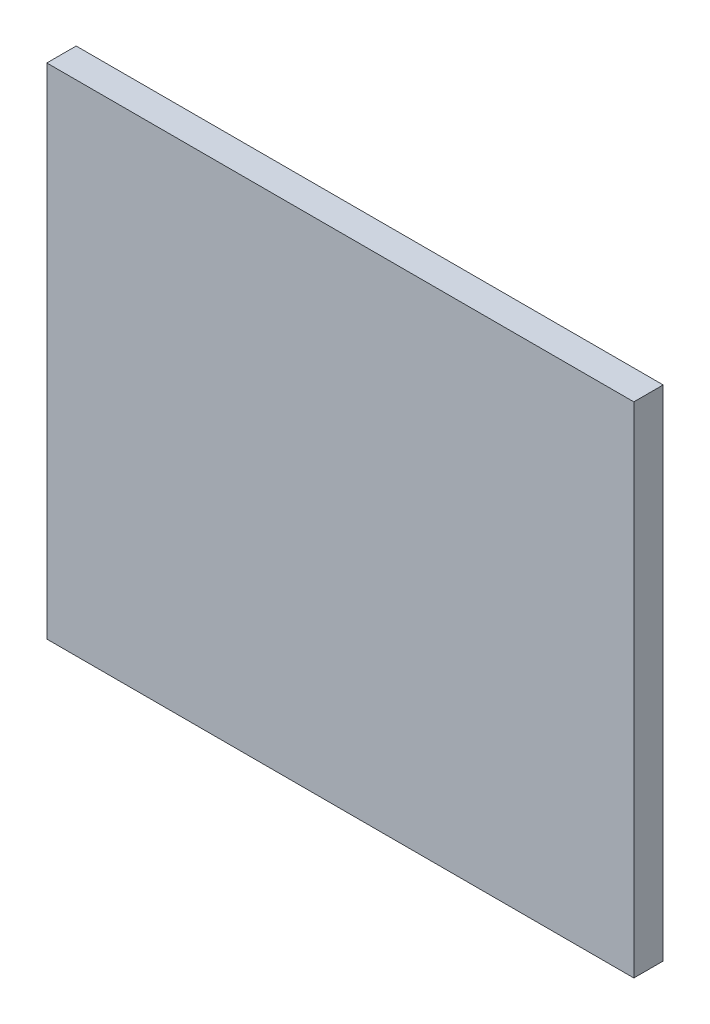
ISO-10303-21;
HEADER;
FILE_DESCRIPTION(('STEP AP214'),'2;1');
FILE_NAME('part.step','',(''),(''),'','','');
FILE_SCHEMA(('AUTOMOTIVE_DESIGN { 1 0 10303 214 1 1 1 1 }'));
ENDSEC;
DATA;
#1=APPLICATION_CONTEXT('core data for automotive mechanical design processes');
#2=APPLICATION_PROTOCOL_DEFINITION('international standard','automotive_design',2000,#1);
#3=PRODUCT_CONTEXT('',#1,'mechanical');
#4=PRODUCT('Part','Part','',(#3));
#5=PRODUCT_RELATED_PRODUCT_CATEGORY('part','',(#4));
#6=PRODUCT_DEFINITION_FORMATION('','',#4);
#7=PRODUCT_DEFINITION_CONTEXT('part definition',#1,'design');
#8=PRODUCT_DEFINITION('design','',#6,#7);
#9=PRODUCT_DEFINITION_SHAPE('','',#8);
#10=(LENGTH_UNIT() NAMED_UNIT(*) SI_UNIT(.MILLI.,.METRE.));
#11=(NAMED_UNIT(*) PLANE_ANGLE_UNIT() SI_UNIT($,.RADIAN.));
#12=(NAMED_UNIT(*) SI_UNIT($,.STERADIAN.) SOLID_ANGLE_UNIT());
#13=UNCERTAINTY_MEASURE_WITH_UNIT(LENGTH_MEASURE(1.E-05),#10,'distance_accuracy_value','');
#14=(GEOMETRIC_REPRESENTATION_CONTEXT(3) GLOBAL_UNCERTAINTY_ASSIGNED_CONTEXT((#13)) GLOBAL_UNIT_ASSIGNED_CONTEXT((#10,
#11,#12)) REPRESENTATION_CONTEXT('',''));
#15=CARTESIAN_POINT('',(0.,0.,0.));
#16=DIRECTION('',(0.,0.,1.));
#17=DIRECTION('',(1.,0.,0.));
#18=AXIS2_PLACEMENT_3D('',#15,#16,#17);
#19=CARTESIAN_POINT('',(1.,0.849999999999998,0.1));
#20=DIRECTION('',(-1.,0.,0.));
#21=DIRECTION('',(0.,0.,1.));
#22=AXIS2_PLACEMENT_3D('',#19,#20,#21);
#23=PLANE('',#22);
#24=DIRECTION('',(0.,1.,0.));
#25=VECTOR('',#24,1.);
#26=CARTESIAN_POINT('',(1.,0.849999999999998,0.));
#27=LINE('',#26,#25);
#28=CARTESIAN_POINT('',(1.,-0.850000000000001,0.));
#29=VERTEX_POINT('',#28);
#30=CARTESIAN_POINT('',(1.,0.849999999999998,0.));
#31=VERTEX_POINT('',#30);
#32=EDGE_CURVE('E95',#29,#31,#27,.T.);
#33=ORIENTED_EDGE('',*,*,#32,.T.);
#34=DIRECTION('',(0.,0.,-1.));
#35=VECTOR('',#34,1.);
#36=CARTESIAN_POINT('',(1.,0.849999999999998,0.1));
#37=LINE('',#36,#35);
#38=CARTESIAN_POINT('',(1.,0.849999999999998,0.1));
#39=VERTEX_POINT('',#38);
#40=EDGE_CURVE('E11',#39,#31,#37,.T.);
#41=ORIENTED_EDGE('',*,*,#40,.F.);
#42=DIRECTION('',(0.,1.,0.));
#43=VECTOR('',#42,1.);
#44=CARTESIAN_POINT('',(1.,0.849999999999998,0.1));
#45=LINE('',#44,#43);
#46=CARTESIAN_POINT('',(1.,-0.850000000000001,0.1));
#47=VERTEX_POINT('',#46);
#48=EDGE_CURVE('E83',#47,#39,#45,.T.);
#49=ORIENTED_EDGE('',*,*,#48,.F.);
#50=DIRECTION('',(0.,0.,-1.));
#51=VECTOR('',#50,1.);
#52=CARTESIAN_POINT('',(1.,-0.850000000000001,0.1));
#53=LINE('',#52,#51);
#54=EDGE_CURVE('E91',#47,#29,#53,.T.);
#55=ORIENTED_EDGE('',*,*,#54,.T.);
#56=EDGE_LOOP('',(#33,#41,#49,#55));
#57=FACE_BOUND('',#56,.T.);
#58=ADVANCED_FACE('F32',(#57),#23,.F.);
#59=CARTESIAN_POINT('',(-0.999999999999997,0.849999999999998,0.1));
#60=DIRECTION('',(0.,-1.,0.));
#61=DIRECTION('',(0.,0.,-1.));
#62=AXIS2_PLACEMENT_3D('',#59,#60,#61);
#63=PLANE('',#62);
#64=DIRECTION('',(-1.,0.,0.));
#65=VECTOR('',#64,1.);
#66=CARTESIAN_POINT('',(-0.999999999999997,0.849999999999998,0.));
#67=LINE('',#66,#65);
#68=CARTESIAN_POINT('',(-0.999999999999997,0.849999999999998,0.));
#69=VERTEX_POINT('',#68);
#70=EDGE_CURVE('E87',#31,#69,#67,.T.);
#71=ORIENTED_EDGE('',*,*,#70,.T.);
#72=DIRECTION('',(0.,0.,-1.));
#73=VECTOR('',#72,1.);
#74=CARTESIAN_POINT('',(-0.999999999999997,0.849999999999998,0.1));
#75=LINE('',#74,#73);
#76=CARTESIAN_POINT('',(-0.999999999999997,0.849999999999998,0.1));
#77=VERTEX_POINT('',#76);
#78=EDGE_CURVE('E40',#77,#69,#75,.T.);
#79=ORIENTED_EDGE('',*,*,#78,.F.);
#80=DIRECTION('',(-1.,0.,0.));
#81=VECTOR('',#80,1.);
#82=CARTESIAN_POINT('',(-0.999999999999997,0.849999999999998,0.1));
#83=LINE('',#82,#81);
#84=EDGE_CURVE('E78',#39,#77,#83,.T.);
#85=ORIENTED_EDGE('',*,*,#84,.F.);
#86=ORIENTED_EDGE('',*,*,#40,.T.);
#87=EDGE_LOOP('',(#71,#79,#85,#86));
#88=FACE_BOUND('',#87,.T.);
#89=ADVANCED_FACE('F86',(#88),#63,.F.);
#90=CARTESIAN_POINT('',(-0.999999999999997,0.849999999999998,0.1));
#91=DIRECTION('',(1.,0.,0.));
#92=DIRECTION('',(0.,0.,-1.));
#93=AXIS2_PLACEMENT_3D('',#90,#91,#92);
#94=PLANE('',#93);
#95=DIRECTION('',(0.,-1.,0.));
#96=VECTOR('',#95,1.);
#97=CARTESIAN_POINT('',(-0.999999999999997,0.849999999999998,0.));
#98=LINE('',#97,#96);
#99=CARTESIAN_POINT('',(-0.999999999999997,-0.850000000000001,0.));
#100=VERTEX_POINT('',#99);
#101=EDGE_CURVE('E65',#69,#100,#98,.T.);
#102=ORIENTED_EDGE('',*,*,#101,.T.);
#103=DIRECTION('',(0.,0.,-1.));
#104=VECTOR('',#103,1.);
#105=CARTESIAN_POINT('',(-0.999999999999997,-0.850000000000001,0.1));
#106=LINE('',#105,#104);
#107=CARTESIAN_POINT('',(-0.999999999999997,-0.850000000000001,0.1));
#108=VERTEX_POINT('',#107);
#109=EDGE_CURVE('E88',#108,#100,#106,.T.);
#110=ORIENTED_EDGE('',*,*,#109,.F.);
#111=DIRECTION('',(0.,-1.,0.));
#112=VECTOR('',#111,1.);
#113=CARTESIAN_POINT('',(-0.999999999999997,0.849999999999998,0.1));
#114=LINE('',#113,#112);
#115=EDGE_CURVE('E81',#77,#108,#114,.T.);
#116=ORIENTED_EDGE('',*,*,#115,.F.);
#117=ORIENTED_EDGE('',*,*,#78,.T.);
#118=EDGE_LOOP('',(#102,#110,#116,#117));
#119=FACE_BOUND('',#118,.T.);
#120=ADVANCED_FACE('F89',(#119),#94,.F.);
#121=CARTESIAN_POINT('',(-0.999999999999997,-0.850000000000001,0.1));
#122=DIRECTION('',(0.,1.,0.));
#123=DIRECTION('',(0.,0.,1.));
#124=AXIS2_PLACEMENT_3D('',#121,#122,#123);
#125=PLANE('',#124);
#126=DIRECTION('',(1.,0.,0.));
#127=VECTOR('',#126,1.);
#128=CARTESIAN_POINT('',(-0.999999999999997,-0.850000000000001,0.));
#129=LINE('',#128,#127);
#130=EDGE_CURVE('E71',#100,#29,#129,.T.);
#131=ORIENTED_EDGE('',*,*,#130,.T.);
#132=ORIENTED_EDGE('',*,*,#54,.F.);
#133=DIRECTION('',(1.,0.,0.));
#134=VECTOR('',#133,1.);
#135=CARTESIAN_POINT('',(-0.999999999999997,-0.850000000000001,0.1));
#136=LINE('',#135,#134);
#137=EDGE_CURVE('E48',#108,#47,#136,.T.);
#138=ORIENTED_EDGE('',*,*,#137,.F.);
#139=ORIENTED_EDGE('',*,*,#109,.T.);
#140=EDGE_LOOP('',(#131,#132,#138,#139));
#141=FACE_BOUND('',#140,.T.);
#142=ADVANCED_FACE('F102',(#141),#125,.F.);
#143=CARTESIAN_POINT('',(0.,0.,0.1));
#144=DIRECTION('',(0.,0.,1.));
#145=DIRECTION('',(1.,0.,0.));
#146=AXIS2_PLACEMENT_3D('',#143,#144,#145);
#147=PLANE('',#146);
#148=ORIENTED_EDGE('',*,*,#48,.T.);
#149=ORIENTED_EDGE('',*,*,#84,.T.);
#150=ORIENTED_EDGE('',*,*,#115,.T.);
#151=ORIENTED_EDGE('',*,*,#137,.T.);
#152=EDGE_LOOP('',(#148,#149,#150,#151));
#153=FACE_BOUND('',#152,.T.);
#154=ADVANCED_FACE('F79',(#153),#147,.T.);
#155=CARTESIAN_POINT('',(0.,0.,0.));
#156=DIRECTION('',(0.,0.,1.));
#157=DIRECTION('',(1.,0.,0.));
#158=AXIS2_PLACEMENT_3D('',#155,#156,#157);
#159=PLANE('',#158);
#160=ORIENTED_EDGE('',*,*,#32,.F.);
#161=ORIENTED_EDGE('',*,*,#130,.F.);
#162=ORIENTED_EDGE('',*,*,#101,.F.);
#163=ORIENTED_EDGE('',*,*,#70,.F.);
#164=EDGE_LOOP('',(#160,#161,#162,#163));
#165=FACE_BOUND('',#164,.T.);
#166=ADVANCED_FACE('F105',(#165),#159,.F.);
#167=CLOSED_SHELL('',(#58,#89,#120,#142,#154,#166));
#168=MANIFOLD_SOLID_BREP('B2',#167);
#169=ADVANCED_BREP_SHAPE_REPRESENTATION('',(#18,#168),#14);
#170=SHAPE_DEFINITION_REPRESENTATION(#9,#169);
ENDSEC;
END-ISO-10303-21;
